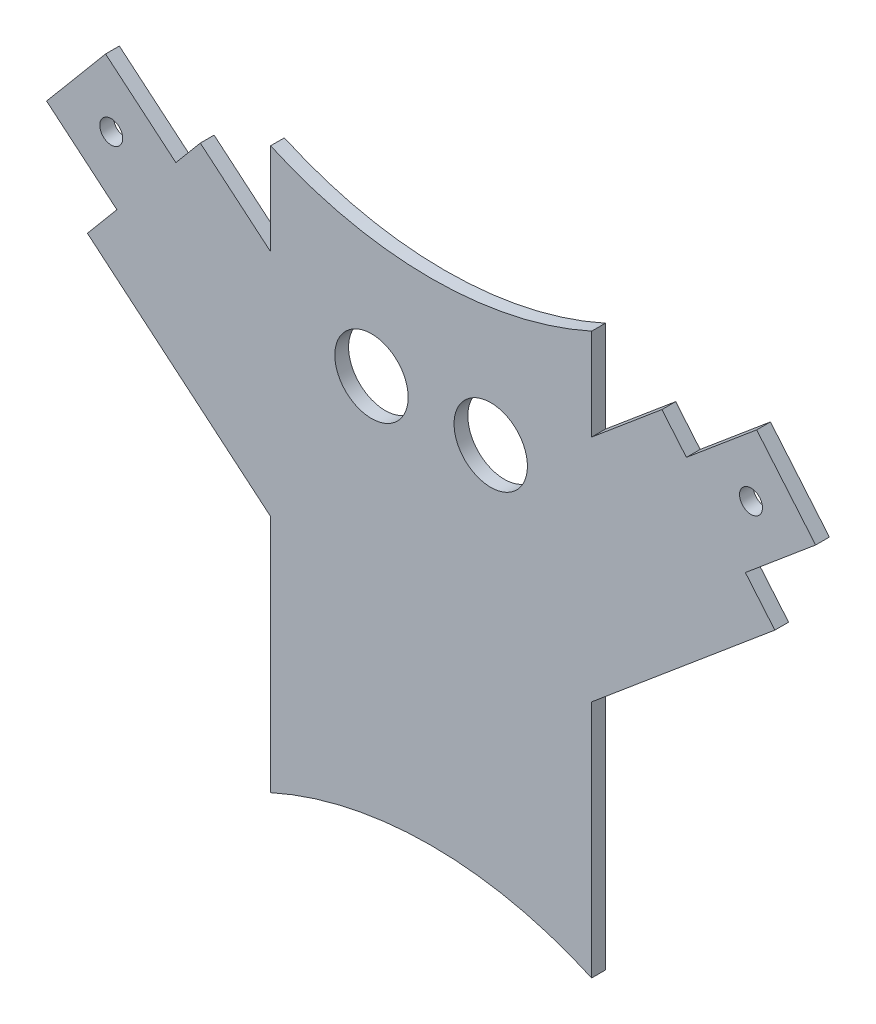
from build123d import *

# Parameters (mm, degrees)
SKIZZE1_R                       = 8
AUFSATZ_LINEAR_AUSTRAGEN1_DEPTH = 1.5
SKIZZE1_3_W                     = 70
SKIZZE1_3_H                     = 50
SKIZZE1_3_R                     = 8
SKIZZE1_3_R_2                   = 2.5
AUFSATZ_LINEAR_AUSTRAGEN2_DEPTH = 1.5


with BuildPart() as part:
    # Skizze1 → Aufsatz-Linear austragen1 (new, symmetric)
    with BuildSketch(Plane.XY):
        with BuildLine():
            Line((-35, -25), (-74.941082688, 8.514547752))
            Line((-74.941082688, 8.514547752), (-50.320888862, 37.855752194))
            Line((-50.320888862, 37.855752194), (-35, 25))
            Line((-35, 25), (-35, 45))
            ThreePointArc((-35, 45), (0, 37.459666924), (35, 45))
            Line((35, 45), (35, 25))
            Line((35, 25), (50.320888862, 37.855752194))
            Line((50.320888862, 37.855752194), (74.941082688, 8.514547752))
            Line((74.941082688, 8.514547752), (35, -25))
            Line((35, -25), (35, -77.139380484))
            ThreePointArc((35, -77.139380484), (0, -69.599047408), (-35, -77.139380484))
            Line((-35, -77.139380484), (-35, -25))
        make_face()
        with Locations((13, 12.5)):
            Circle(SKIZZE1_R, mode=Mode.SUBTRACT)
        with Locations((-13, 12.5)):
            Circle(SKIZZE1_R, mode=Mode.SUBTRACT)
    extrude(amount=AUFSATZ_LINEAR_AUSTRAGEN1_DEPTH, both=True)

    # Skizze1_3 → Aufsatz-Linear austragen2 (add, symmetric)
    # profile 1 of 7: a face of its own
    with BuildSketch(Plane.XY):
        with BuildLine():
            Line((-35, 45), (-35, 25))
            Line((-35, 25), (35, 25))
            Line((35, 25), (35, 45))
            ThreePointArc((35, 45), (0, 37.459666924), (-35, 45))
        make_face()
    # profile 2 of 7: a face of its own
    with BuildSketch(Plane.XY):
        Rectangle(SKIZZE1_3_W, SKIZZE1_3_H)
        with Locations((-13, 12.5)):
            Circle(SKIZZE1_3_R, mode=Mode.SUBTRACT)
        with Locations((13, 12.5)):
            Circle(SKIZZE1_3_R, mode=Mode.SUBTRACT)
    # profile 3 of 7: a face of its own
    with BuildSketch(Plane.XY):
        Polygon((-35, -25), (-35, 25), (-50.320888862, 37.855752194), (-55.657454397, 31.495881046), (-68.513206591, 16.174992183), (-74.941082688, 8.514547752), align=None)
    # profile 4 of 7: a face of its own
    with BuildSketch(Plane.XY):
        Polygon((50.320888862, 37.855752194), (35, 25), (35, -25), (74.941082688, 8.514547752), (68.513206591, 16.174992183), (55.657454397, 31.495881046), align=None)
    # profile 5 of 7: a face of its own
    with BuildSketch(Plane.XY):
        with BuildLine():
            Line((35, -25), (-35, -25))
            Line((-35, -25), (-35, -77.139380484))
            ThreePointArc((-35, -77.139380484), (0, -69.599047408), (35, -77.139380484))
            Line((35, -77.139380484), (35, -25))
        make_face()
    # profile 6 of 7: a face of its own
    with BuildSketch(Plane.XY):
        Polygon((-68.513206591, 16.174992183), (-55.657454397, 31.495881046), (-70.978343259, 44.351633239), (-83.834095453, 29.030744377), align=None)
        with Locations((-69.745774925, 30.263312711)):
            Circle(SKIZZE1_3_R_2, mode=Mode.SUBTRACT)
    # profile 7 of 7: a face of its own
    with BuildSketch(Plane.XY):
        Polygon((70.978343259, 44.351633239), (55.657454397, 31.495881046), (68.513206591, 16.174992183), (83.834095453, 29.030744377), align=None)
        with Locations((69.745774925, 30.263312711)):
            Circle(SKIZZE1_3_R_2, mode=Mode.SUBTRACT)
    extrude(amount=AUFSATZ_LINEAR_AUSTRAGEN2_DEPTH, both=True)


solid = part.part
